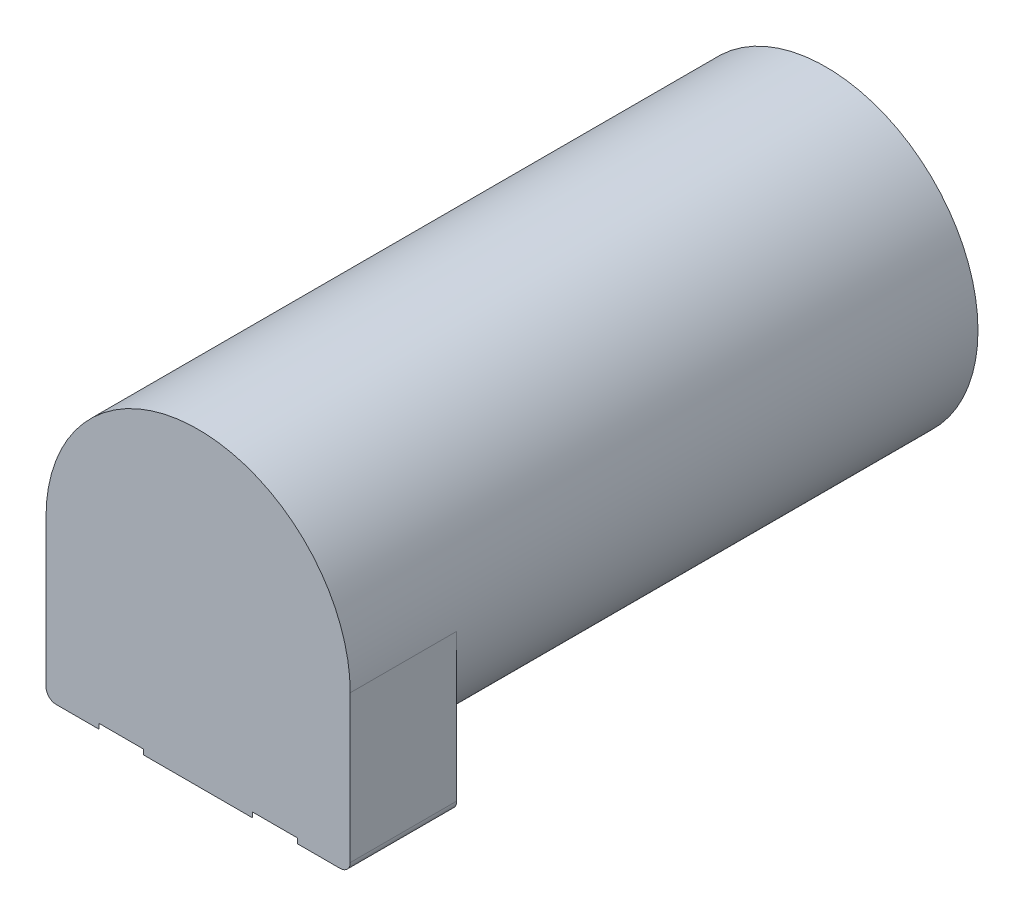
from build123d import *

# Parameters (mm, degrees)
ESQUISSE1_W               = 5
ESQUISSE1_H               = 15.75
ESQUISSE5_R               = 30
EXTRUSION2_DEPTH          = 123.8
EXTRUSION3_START          = -21
EXTRUSION3_DEPTH          = 21
ESQUISSE7_R               = 12.5
ENL_V_MAT_EXTRU_1_DEPTH   = 1
ESQUISSE8_R               = 7.475
ENL_V_MAT_EXTRU_2_DEPTH   = 30
TROU_TARAUD_M6X1_02_D     = 5
TROU_TARAUD_M6X1_02_DEPTH = 15
TROU_TARAUD_M6X1_02_TIP   = 1.502151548
CHANFREIN1_SIZE           = 1


with BuildPart() as part:
    # Esquisse1 → R_volution1 (revolve)
    with BuildSketch(Plane(origin=(0, 0, 0), x_dir=(0, 0, -1), z_dir=(1, 0, 0)), mode=Mode.PRIVATE) as r_volution1_sk:
        with Locations((2.5, 7.875)):
            Rectangle(ESQUISSE1_W, ESQUISSE1_H)
    revolve(r_volution1_sk.sketch.rotate(Axis((0, 0, 0), (0, 0, -1)), 90), axis=Axis((0, 0, 0), (0, 0, -1)))

    # Esquisse5 → Extrusion2 (add)
    with BuildSketch(Plane.XY):
        Circle(ESQUISSE5_R)
    extrude(amount=EXTRUSION2_DEPTH)

    # Esquisse6 → Extrusion3 (add)
    with BuildSketch(Plane.XY.offset(123.8).offset(EXTRUSION3_START)):
        with BuildLine():
            Line((-30, 0), (-30, -29))
            ThreePointArc((-30, -29), (-29.414213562, -30.414213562), (-28, -31))
            Line((-28, -31), (28, -31))
            ThreePointArc((28, -31), (29.414213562, -30.414213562), (30, -29))
            Line((30, -29), (30, 0))
            ThreePointArc((30, 0), (0, -30), (-30, 0))
        make_face()
    extrude(amount=EXTRUSION3_DEPTH)

    # Esquisse7 → Enl_v. mat.-Extru.1 (cut)
    with BuildSketch(Plane.XZ.offset(31)):
        with Locations((-15.15, 112.1)):
            Circle(ESQUISSE7_R)
        with Locations((15.15, 112.1)):
            Circle(ESQUISSE7_R)
    extrude(amount=-ENL_V_MAT_EXTRU_1_DEPTH, mode=Mode.SUBTRACT)

    # Esquisse8 → Enl_v. mat.-Extru.2 (cut)
    with BuildSketch(Plane.XZ.offset(30)):
        with Locations((15.15, 112.1)):
            Circle(ESQUISSE8_R)
        with Locations((-15.15, 112.1)):
            Circle(ESQUISSE8_R)
    extrude(amount=-ENL_V_MAT_EXTRU_2_DEPTH, mode=Mode.SUBTRACT)

    # Trou taraud_ M6x1.02
    with Locations(Plane(origin=(0, -22.5, 0), x_dir=(-1, 0, 0), z_dir=(0, 0, -1))):
        with Locations((0, 0), (15.909902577, 38.409902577), (-15.909902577, 38.409902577)):
            Hole(TROU_TARAUD_M6X1_02_D / 2, depth=TROU_TARAUD_M6X1_02_DEPTH)
            with Locations((0, 0, -(TROU_TARAUD_M6X1_02_DEPTH + TROU_TARAUD_M6X1_02_TIP / 2))):  # 118° drill point
                Cone(0, TROU_TARAUD_M6X1_02_D / 2, TROU_TARAUD_M6X1_02_TIP, mode=Mode.SUBTRACT)

    # Chanfrein1
    chanfrein1_edges = [part.edges().sort_by_distance(p)[0] for p in [
        (-15.75, 0, -5),
    ]]
    chamfer(chanfrein1_edges, length=CHANFREIN1_SIZE)


solid = part.part
